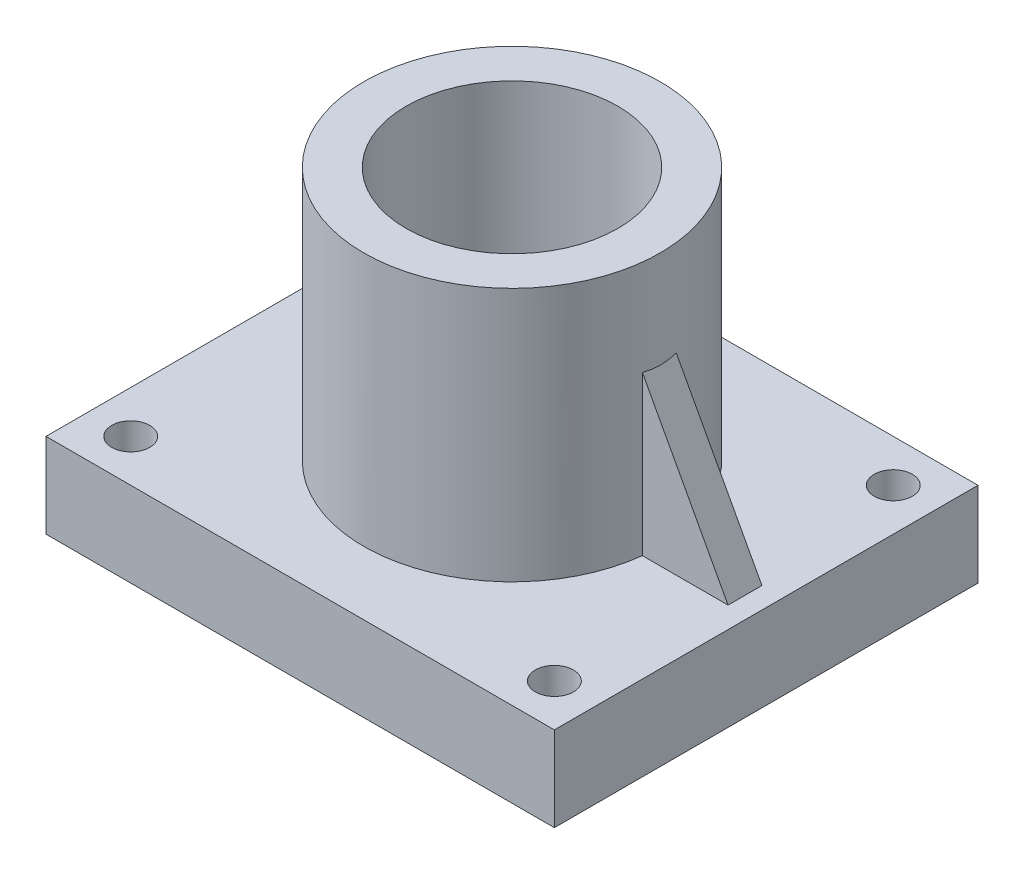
ISO-10303-21;
HEADER;
FILE_DESCRIPTION(('STEP AP214'),'2;1');
FILE_NAME('part.step','',(''),(''),'','','');
FILE_SCHEMA(('AUTOMOTIVE_DESIGN { 1 0 10303 214 1 1 1 1 }'));
ENDSEC;
DATA;
#1=APPLICATION_CONTEXT('core data for automotive mechanical design processes');
#2=APPLICATION_PROTOCOL_DEFINITION('international standard','automotive_design',2000,#1);
#3=PRODUCT_CONTEXT('',#1,'mechanical');
#4=PRODUCT('Part','Part','',(#3));
#5=PRODUCT_RELATED_PRODUCT_CATEGORY('part','',(#4));
#6=PRODUCT_DEFINITION_FORMATION('','',#4);
#7=PRODUCT_DEFINITION_CONTEXT('part definition',#1,'design');
#8=PRODUCT_DEFINITION('design','',#6,#7);
#9=PRODUCT_DEFINITION_SHAPE('','',#8);
#10=(LENGTH_UNIT() NAMED_UNIT(*) SI_UNIT(.MILLI.,.METRE.));
#11=(NAMED_UNIT(*) PLANE_ANGLE_UNIT() SI_UNIT($,.RADIAN.));
#12=(NAMED_UNIT(*) SI_UNIT($,.STERADIAN.) SOLID_ANGLE_UNIT());
#13=UNCERTAINTY_MEASURE_WITH_UNIT(LENGTH_MEASURE(1.E-05),#10,'distance_accuracy_value','');
#14=(GEOMETRIC_REPRESENTATION_CONTEXT(3) GLOBAL_UNCERTAINTY_ASSIGNED_CONTEXT((#13)) GLOBAL_UNIT_ASSIGNED_CONTEXT((#10,
#11,#12)) REPRESENTATION_CONTEXT('',''));
#15=CARTESIAN_POINT('',(0.,0.,0.));
#16=DIRECTION('',(0.,0.,1.));
#17=DIRECTION('',(1.,0.,0.));
#18=AXIS2_PLACEMENT_3D('',#15,#16,#17);
#19=CARTESIAN_POINT('',(0.,20.,0.));
#20=DIRECTION('',(0.,-1.,0.));
#21=DIRECTION('',(0.,0.,-1.));
#22=AXIS2_PLACEMENT_3D('',#19,#20,#21);
#23=PLANE('',#22);
#24=CARTESIAN_POINT('',(-50.,20.,40.));
#25=DIRECTION('',(0.,-1.,0.));
#26=DIRECTION('',(0.,0.,-1.));
#27=AXIS2_PLACEMENT_3D('',#24,#25,#26);
#28=CIRCLE('',#27,4.5);
#29=CARTESIAN_POINT('',(-50.,20.,35.5));
#30=VERTEX_POINT('',#29);
#31=EDGE_CURVE('E335',#30,#30,#28,.F.);
#32=ORIENTED_EDGE('',*,*,#31,.F.);
#33=EDGE_LOOP('',(#32));
#34=FACE_BOUND('',#33,.T.);
#35=CARTESIAN_POINT('',(50.,20.,40.));
#36=DIRECTION('',(0.,-1.,0.));
#37=DIRECTION('',(0.,0.,-1.));
#38=AXIS2_PLACEMENT_3D('',#35,#36,#37);
#39=CIRCLE('',#38,4.5);
#40=CARTESIAN_POINT('',(50.,20.,35.5));
#41=VERTEX_POINT('',#40);
#42=EDGE_CURVE('E338',#41,#41,#39,.F.);
#43=ORIENTED_EDGE('',*,*,#42,.F.);
#44=EDGE_LOOP('',(#43));
#45=FACE_BOUND('',#44,.T.);
#46=CARTESIAN_POINT('',(-50.,20.,-40.));
#47=DIRECTION('',(0.,-1.,0.));
#48=DIRECTION('',(0.,0.,-1.));
#49=AXIS2_PLACEMENT_3D('',#46,#47,#48);
#50=CIRCLE('',#49,4.5);
#51=CARTESIAN_POINT('',(-50.,20.,-44.5));
#52=VERTEX_POINT('',#51);
#53=EDGE_CURVE('E344',#52,#52,#50,.F.);
#54=ORIENTED_EDGE('',*,*,#53,.F.);
#55=EDGE_LOOP('',(#54));
#56=FACE_BOUND('',#55,.T.);
#57=CARTESIAN_POINT('',(50.,20.,-40.));
#58=DIRECTION('',(0.,-1.,0.));
#59=DIRECTION('',(0.,0.,-1.));
#60=AXIS2_PLACEMENT_3D('',#57,#58,#59);
#61=CIRCLE('',#60,4.5);
#62=CARTESIAN_POINT('',(50.,20.,-44.5));
#63=VERTEX_POINT('',#62);
#64=EDGE_CURVE('E133',#63,#63,#61,.F.);
#65=ORIENTED_EDGE('',*,*,#64,.F.);
#66=EDGE_LOOP('',(#65));
#67=FACE_BOUND('',#66,.T.);
#68=DIRECTION('',(0.,0.,-1.));
#69=VECTOR('',#68,1.);
#70=CARTESIAN_POINT('',(60.,20.,50.));
#71=LINE('',#70,#69);
#72=CARTESIAN_POINT('',(60.,20.,50.));
#73=VERTEX_POINT('',#72);
#74=CARTESIAN_POINT('',(60.,20.,-50.));
#75=VERTEX_POINT('',#74);
#76=EDGE_CURVE('E144',#73,#75,#71,.T.);
#77=ORIENTED_EDGE('',*,*,#76,.T.);
#78=DIRECTION('',(-1.,0.,0.));
#79=VECTOR('',#78,1.);
#80=CARTESIAN_POINT('',(-60.,20.,-50.));
#81=LINE('',#80,#79);
#82=CARTESIAN_POINT('',(-60.,20.,-50.));
#83=VERTEX_POINT('',#82);
#84=EDGE_CURVE('E94',#75,#83,#81,.T.);
#85=ORIENTED_EDGE('',*,*,#84,.T.);
#86=DIRECTION('',(0.,0.,1.));
#87=VECTOR('',#86,1.);
#88=CARTESIAN_POINT('',(-60.,20.,50.));
#89=LINE('',#88,#87);
#90=CARTESIAN_POINT('',(-60.,20.,50.));
#91=VERTEX_POINT('',#90);
#92=EDGE_CURVE('E146',#83,#91,#89,.T.);
#93=ORIENTED_EDGE('',*,*,#92,.T.);
#94=DIRECTION('',(1.,0.,0.));
#95=VECTOR('',#94,1.);
#96=CARTESIAN_POINT('',(-60.,20.,50.));
#97=LINE('',#96,#95);
#98=EDGE_CURVE('E64',#91,#73,#97,.T.);
#99=ORIENTED_EDGE('',*,*,#98,.T.);
#100=EDGE_LOOP('',(#77,#85,#93,#99));
#101=FACE_BOUND('',#100,.T.);
#102=DIRECTION('',(1.,0.,0.));
#103=VECTOR('',#102,1.);
#104=CARTESIAN_POINT('',(28.,20.,4.));
#105=LINE('',#104,#103);
#106=CARTESIAN_POINT('',(34.7706773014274,20.,4.));
#107=VERTEX_POINT('',#106);
#108=CARTESIAN_POINT('',(55.,20.,4.));
#109=VERTEX_POINT('',#108);
#110=EDGE_CURVE('E126',#107,#109,#105,.T.);
#111=ORIENTED_EDGE('',*,*,#110,.F.);
#112=CARTESIAN_POINT('',(0.,20.,0.));
#113=DIRECTION('',(0.,1.,0.));
#114=DIRECTION('',(0.,0.,1.));
#115=AXIS2_PLACEMENT_3D('',#112,#113,#114);
#116=CIRCLE('',#115,35.);
#117=CARTESIAN_POINT('',(34.7706773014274,20.,-4.));
#118=VERTEX_POINT('',#117);
#119=EDGE_CURVE('E127',#118,#107,#116,.T.);
#120=ORIENTED_EDGE('',*,*,#119,.F.);
#121=DIRECTION('',(1.,0.,0.));
#122=VECTOR('',#121,1.);
#123=CARTESIAN_POINT('',(28.,20.,-4.));
#124=LINE('',#123,#122);
#125=CARTESIAN_POINT('',(55.,20.,-4.));
#126=VERTEX_POINT('',#125);
#127=EDGE_CURVE('E121',#118,#126,#124,.T.);
#128=ORIENTED_EDGE('',*,*,#127,.T.);
#129=DIRECTION('',(0.,0.,1.));
#130=VECTOR('',#129,1.);
#131=CARTESIAN_POINT('',(55.,20.,-4.));
#132=LINE('',#131,#130);
#133=EDGE_CURVE('E108',#126,#109,#132,.T.);
#134=ORIENTED_EDGE('',*,*,#133,.T.);
#135=EDGE_LOOP('',(#111,#120,#128,#134));
#136=FACE_BOUND('',#135,.T.);
#137=ADVANCED_FACE('F41',(#34,#45,#56,#67,#101,#136),#23,.F.);
#138=CARTESIAN_POINT('',(0.,80.,0.));
#139=DIRECTION('',(0.,-1.,0.));
#140=DIRECTION('',(0.,0.,-1.));
#141=AXIS2_PLACEMENT_3D('',#138,#139,#140);
#142=CYLINDRICAL_SURFACE('',#141,35.);
#143=CARTESIAN_POINT('',(0.,80.,0.));
#144=DIRECTION('',(0.,1.,0.));
#145=DIRECTION('',(0.,0.,1.));
#146=AXIS2_PLACEMENT_3D('',#143,#144,#145);
#147=CIRCLE('',#146,35.);
#148=CARTESIAN_POINT('',(0.,80.,35.));
#149=VERTEX_POINT('',#148);
#150=EDGE_CURVE('E137',#149,#149,#147,.T.);
#151=ORIENTED_EDGE('',*,*,#150,.F.);
#152=EDGE_LOOP('',(#151));
#153=FACE_BOUND('',#152,.T.);
#154=DIRECTION('',(0.,-1.,0.));
#155=VECTOR('',#154,1.);
#156=CARTESIAN_POINT('',(34.7706773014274,80.,-4.));
#157=LINE('',#156,#155);
#158=CARTESIAN_POINT('',(34.7706773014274,57.4617087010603,-4.));
#159=VERTEX_POINT('',#158);
#160=EDGE_CURVE('E11',#118,#159,#157,.F.);
#161=ORIENTED_EDGE('',*,*,#160,.F.);
#162=ORIENTED_EDGE('',*,*,#119,.T.);
#163=DIRECTION('',(0.,-1.,0.));
#164=VECTOR('',#163,1.);
#165=CARTESIAN_POINT('',(34.7706773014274,80.,4.));
#166=LINE('',#165,#164);
#167=CARTESIAN_POINT('',(34.7706773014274,57.4617087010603,4.));
#168=VERTEX_POINT('',#167);
#169=EDGE_CURVE('E141',#107,#168,#166,.F.);
#170=ORIENTED_EDGE('',*,*,#169,.T.);
#171=CARTESIAN_POINT('',(0.,121.851851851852,0.));
#172=DIRECTION('',(0.879905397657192,0.475148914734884,0.));
#173=DIRECTION('',(0.475148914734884,-0.879905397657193,0.));
#174=AXIS2_PLACEMENT_3D('',#171,#172,#173);
#175=ELLIPSE('',#174,73.6611174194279,35.);
#176=EDGE_CURVE('E47',#168,#159,#175,.T.);
#177=ORIENTED_EDGE('',*,*,#176,.T.);
#178=EDGE_LOOP('',(#161,#162,#170,#177));
#179=FACE_BOUND('',#178,.T.);
#180=ADVANCED_FACE('F168',(#153,#179),#142,.T.);
#181=CARTESIAN_POINT('',(60.,20.,50.));
#182=DIRECTION('',(-1.,0.,0.));
#183=DIRECTION('',(0.,0.,1.));
#184=AXIS2_PLACEMENT_3D('',#181,#182,#183);
#185=PLANE('',#184);
#186=DIRECTION('',(0.,0.,-1.));
#187=VECTOR('',#186,1.);
#188=CARTESIAN_POINT('',(60.,0.,50.));
#189=LINE('',#188,#187);
#190=CARTESIAN_POINT('',(60.,0.,50.));
#191=VERTEX_POINT('',#190);
#192=CARTESIAN_POINT('',(60.,0.,-50.));
#193=VERTEX_POINT('',#192);
#194=EDGE_CURVE('E143',#191,#193,#189,.T.);
#195=ORIENTED_EDGE('',*,*,#194,.T.);
#196=DIRECTION('',(0.,-1.,0.));
#197=VECTOR('',#196,1.);
#198=CARTESIAN_POINT('',(60.,20.,-50.));
#199=LINE('',#198,#197);
#200=EDGE_CURVE('E145',#75,#193,#199,.T.);
#201=ORIENTED_EDGE('',*,*,#200,.F.);
#202=ORIENTED_EDGE('',*,*,#76,.F.);
#203=DIRECTION('',(0.,-1.,0.));
#204=VECTOR('',#203,1.);
#205=CARTESIAN_POINT('',(60.,20.,50.));
#206=LINE('',#205,#204);
#207=EDGE_CURVE('E151',#73,#191,#206,.T.);
#208=ORIENTED_EDGE('',*,*,#207,.T.);
#209=EDGE_LOOP('',(#195,#201,#202,#208));
#210=FACE_BOUND('',#209,.T.);
#211=ADVANCED_FACE('F43',(#210),#185,.F.);
#212=CARTESIAN_POINT('',(-60.,20.,-50.));
#213=DIRECTION('',(0.,0.,1.));
#214=DIRECTION('',(1.,0.,0.));
#215=AXIS2_PLACEMENT_3D('',#212,#213,#214);
#216=PLANE('',#215);
#217=DIRECTION('',(-1.,0.,0.));
#218=VECTOR('',#217,1.);
#219=CARTESIAN_POINT('',(-60.,0.,-50.));
#220=LINE('',#219,#218);
#221=CARTESIAN_POINT('',(-60.,0.,-50.));
#222=VERTEX_POINT('',#221);
#223=EDGE_CURVE('E152',#193,#222,#220,.T.);
#224=ORIENTED_EDGE('',*,*,#223,.T.);
#225=DIRECTION('',(0.,-1.,0.));
#226=VECTOR('',#225,1.);
#227=CARTESIAN_POINT('',(-60.,20.,-50.));
#228=LINE('',#227,#226);
#229=EDGE_CURVE('E165',#83,#222,#228,.T.);
#230=ORIENTED_EDGE('',*,*,#229,.F.);
#231=ORIENTED_EDGE('',*,*,#84,.F.);
#232=ORIENTED_EDGE('',*,*,#200,.T.);
#233=EDGE_LOOP('',(#224,#230,#231,#232));
#234=FACE_BOUND('',#233,.T.);
#235=ADVANCED_FACE('F202',(#234),#216,.F.);
#236=CARTESIAN_POINT('',(-60.,20.,50.));
#237=DIRECTION('',(1.,0.,0.));
#238=DIRECTION('',(0.,0.,-1.));
#239=AXIS2_PLACEMENT_3D('',#236,#237,#238);
#240=PLANE('',#239);
#241=DIRECTION('',(0.,0.,1.));
#242=VECTOR('',#241,1.);
#243=CARTESIAN_POINT('',(-60.,0.,50.));
#244=LINE('',#243,#242);
#245=CARTESIAN_POINT('',(-60.,0.,50.));
#246=VERTEX_POINT('',#245);
#247=EDGE_CURVE('E156',#222,#246,#244,.T.);
#248=ORIENTED_EDGE('',*,*,#247,.T.);
#249=DIRECTION('',(0.,-1.,0.));
#250=VECTOR('',#249,1.);
#251=CARTESIAN_POINT('',(-60.,20.,50.));
#252=LINE('',#251,#250);
#253=EDGE_CURVE('E159',#91,#246,#252,.T.);
#254=ORIENTED_EDGE('',*,*,#253,.F.);
#255=ORIENTED_EDGE('',*,*,#92,.F.);
#256=ORIENTED_EDGE('',*,*,#229,.T.);
#257=EDGE_LOOP('',(#248,#254,#255,#256));
#258=FACE_BOUND('',#257,.T.);
#259=ADVANCED_FACE('F201',(#258),#240,.F.);
#260=CARTESIAN_POINT('',(-60.,20.,50.));
#261=DIRECTION('',(0.,0.,-1.));
#262=DIRECTION('',(-1.,0.,0.));
#263=AXIS2_PLACEMENT_3D('',#260,#261,#262);
#264=PLANE('',#263);
#265=DIRECTION('',(1.,0.,0.));
#266=VECTOR('',#265,1.);
#267=CARTESIAN_POINT('',(-60.,0.,50.));
#268=LINE('',#267,#266);
#269=EDGE_CURVE('E88',#246,#191,#268,.T.);
#270=ORIENTED_EDGE('',*,*,#269,.T.);
#271=ORIENTED_EDGE('',*,*,#207,.F.);
#272=ORIENTED_EDGE('',*,*,#98,.F.);
#273=ORIENTED_EDGE('',*,*,#253,.T.);
#274=EDGE_LOOP('',(#270,#271,#272,#273));
#275=FACE_BOUND('',#274,.T.);
#276=ADVANCED_FACE('F200',(#275),#264,.F.);
#277=CARTESIAN_POINT('',(0.,0.,0.));
#278=DIRECTION('',(0.,-1.,0.));
#279=DIRECTION('',(0.,0.,-1.));
#280=AXIS2_PLACEMENT_3D('',#277,#278,#279);
#281=PLANE('',#280);
#282=CARTESIAN_POINT('',(-50.,0.,40.));
#283=DIRECTION('',(0.,1.,0.));
#284=DIRECTION('',(0.,0.,1.));
#285=AXIS2_PLACEMENT_3D('',#282,#283,#284);
#286=CIRCLE('',#285,4.5);
#287=CARTESIAN_POINT('',(-50.,0.,44.5));
#288=VERTEX_POINT('',#287);
#289=EDGE_CURVE('E329',#288,#288,#286,.T.);
#290=ORIENTED_EDGE('',*,*,#289,.T.);
#291=EDGE_LOOP('',(#290));
#292=FACE_BOUND('',#291,.T.);
#293=CARTESIAN_POINT('',(50.,0.,40.));
#294=DIRECTION('',(0.,1.,0.));
#295=DIRECTION('',(0.,0.,1.));
#296=AXIS2_PLACEMENT_3D('',#293,#294,#295);
#297=CIRCLE('',#296,4.5);
#298=CARTESIAN_POINT('',(50.,0.,44.5));
#299=VERTEX_POINT('',#298);
#300=EDGE_CURVE('E334',#299,#299,#297,.T.);
#301=ORIENTED_EDGE('',*,*,#300,.T.);
#302=EDGE_LOOP('',(#301));
#303=FACE_BOUND('',#302,.T.);
#304=CARTESIAN_POINT('',(-50.,0.,-40.));
#305=DIRECTION('',(0.,1.,0.));
#306=DIRECTION('',(0.,0.,1.));
#307=AXIS2_PLACEMENT_3D('',#304,#305,#306);
#308=CIRCLE('',#307,4.5);
#309=CARTESIAN_POINT('',(-50.,0.,-35.5));
#310=VERTEX_POINT('',#309);
#311=EDGE_CURVE('E345',#310,#310,#308,.T.);
#312=ORIENTED_EDGE('',*,*,#311,.T.);
#313=EDGE_LOOP('',(#312));
#314=FACE_BOUND('',#313,.T.);
#315=CARTESIAN_POINT('',(50.,0.,-40.));
#316=DIRECTION('',(0.,1.,0.));
#317=DIRECTION('',(0.,0.,1.));
#318=AXIS2_PLACEMENT_3D('',#315,#316,#317);
#319=CIRCLE('',#318,4.5);
#320=CARTESIAN_POINT('',(50.,0.,-35.5));
#321=VERTEX_POINT('',#320);
#322=EDGE_CURVE('E350',#321,#321,#319,.T.);
#323=ORIENTED_EDGE('',*,*,#322,.T.);
#324=EDGE_LOOP('',(#323));
#325=FACE_BOUND('',#324,.T.);
#326=CARTESIAN_POINT('',(0.,0.,0.));
#327=DIRECTION('',(0.,1.,0.));
#328=DIRECTION('',(0.,0.,1.));
#329=AXIS2_PLACEMENT_3D('',#326,#327,#328);
#330=CIRCLE('',#329,25.);
#331=CARTESIAN_POINT('',(0.,0.,25.));
#332=VERTEX_POINT('',#331);
#333=EDGE_CURVE('E120',#332,#332,#330,.T.);
#334=ORIENTED_EDGE('',*,*,#333,.T.);
#335=EDGE_LOOP('',(#334));
#336=FACE_BOUND('',#335,.T.);
#337=ORIENTED_EDGE('',*,*,#194,.F.);
#338=ORIENTED_EDGE('',*,*,#269,.F.);
#339=ORIENTED_EDGE('',*,*,#247,.F.);
#340=ORIENTED_EDGE('',*,*,#223,.F.);
#341=EDGE_LOOP('',(#337,#338,#339,#340));
#342=FACE_BOUND('',#341,.T.);
#343=ADVANCED_FACE('F198',(#292,#303,#314,#325,#336,#342),#281,.T.);
#344=CARTESIAN_POINT('',(0.,80.,0.));
#345=DIRECTION('',(0.,1.,0.));
#346=DIRECTION('',(0.,0.,1.));
#347=AXIS2_PLACEMENT_3D('',#344,#345,#346);
#348=PLANE('',#347);
#349=CARTESIAN_POINT('',(0.,80.,0.));
#350=DIRECTION('',(0.,1.,0.));
#351=DIRECTION('',(0.,0.,1.));
#352=AXIS2_PLACEMENT_3D('',#349,#350,#351);
#353=CIRCLE('',#352,25.);
#354=CARTESIAN_POINT('',(0.,80.,25.));
#355=VERTEX_POINT('',#354);
#356=EDGE_CURVE('E140',#355,#355,#353,.F.);
#357=ORIENTED_EDGE('',*,*,#356,.T.);
#358=EDGE_LOOP('',(#357));
#359=FACE_BOUND('',#358,.T.);
#360=ORIENTED_EDGE('',*,*,#150,.T.);
#361=EDGE_LOOP('',(#360));
#362=FACE_BOUND('',#361,.T.);
#363=ADVANCED_FACE('F196',(#359,#362),#348,.T.);
#364=CARTESIAN_POINT('',(0.,85.,0.));
#365=DIRECTION('',(0.,-1.,0.));
#366=DIRECTION('',(0.,0.,-1.));
#367=AXIS2_PLACEMENT_3D('',#364,#365,#366);
#368=CYLINDRICAL_SURFACE('',#367,25.);
#369=ORIENTED_EDGE('',*,*,#356,.F.);
#370=EDGE_LOOP('',(#369));
#371=FACE_BOUND('',#370,.T.);
#372=ORIENTED_EDGE('',*,*,#333,.F.);
#373=EDGE_LOOP('',(#372));
#374=FACE_BOUND('',#373,.T.);
#375=ADVANCED_FACE('F179',(#371,#374),#368,.F.);
#376=CARTESIAN_POINT('',(0.,0.,-4.));
#377=DIRECTION('',(0.,0.,1.));
#378=DIRECTION('',(1.,0.,0.));
#379=AXIS2_PLACEMENT_3D('',#376,#377,#378);
#380=PLANE('',#379);
#381=ORIENTED_EDGE('',*,*,#127,.F.);
#382=ORIENTED_EDGE('',*,*,#160,.T.);
#383=DIRECTION('',(-0.475148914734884,0.879905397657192,0.));
#384=VECTOR('',#383,1.);
#385=CARTESIAN_POINT('',(55.,20.,-4.));
#386=LINE('',#385,#384);
#387=EDGE_CURVE('E115',#126,#159,#386,.T.);
#388=ORIENTED_EDGE('',*,*,#387,.F.);
#389=EDGE_LOOP('',(#381,#382,#388));
#390=FACE_BOUND('',#389,.T.);
#391=ADVANCED_FACE('F119',(#390),#380,.F.);
#392=CARTESIAN_POINT('',(0.,0.,4.));
#393=DIRECTION('',(0.,0.,1.));
#394=DIRECTION('',(1.,0.,0.));
#395=AXIS2_PLACEMENT_3D('',#392,#393,#394);
#396=PLANE('',#395);
#397=ORIENTED_EDGE('',*,*,#169,.F.);
#398=ORIENTED_EDGE('',*,*,#110,.T.);
#399=DIRECTION('',(-0.475148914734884,0.879905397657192,0.));
#400=VECTOR('',#399,1.);
#401=CARTESIAN_POINT('',(55.,20.,4.));
#402=LINE('',#401,#400);
#403=EDGE_CURVE('E57',#109,#168,#402,.T.);
#404=ORIENTED_EDGE('',*,*,#403,.T.);
#405=EDGE_LOOP('',(#397,#398,#404));
#406=FACE_BOUND('',#405,.T.);
#407=ADVANCED_FACE('F173',(#406),#396,.T.);
#408=CARTESIAN_POINT('',(55.,20.,-4.));
#409=DIRECTION('',(0.879905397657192,0.475148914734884,0.));
#410=DIRECTION('',(-0.475148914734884,0.879905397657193,0.));
#411=AXIS2_PLACEMENT_3D('',#408,#409,#410);
#412=PLANE('',#411);
#413=ORIENTED_EDGE('',*,*,#176,.F.);
#414=ORIENTED_EDGE('',*,*,#403,.F.);
#415=ORIENTED_EDGE('',*,*,#133,.F.);
#416=ORIENTED_EDGE('',*,*,#387,.T.);
#417=EDGE_LOOP('',(#413,#414,#415,#416));
#418=FACE_BOUND('',#417,.T.);
#419=ADVANCED_FACE('F112',(#418),#412,.T.);
#420=CARTESIAN_POINT('',(50.,25.,-40.));
#421=DIRECTION('',(0.,-1.,0.));
#422=DIRECTION('',(0.,0.,-1.));
#423=AXIS2_PLACEMENT_3D('',#420,#421,#422);
#424=CYLINDRICAL_SURFACE('',#423,4.5);
#425=ORIENTED_EDGE('',*,*,#322,.F.);
#426=EDGE_LOOP('',(#425));
#427=FACE_BOUND('',#426,.T.);
#428=ORIENTED_EDGE('',*,*,#64,.T.);
#429=EDGE_LOOP('',(#428));
#430=FACE_BOUND('',#429,.T.);
#431=ADVANCED_FACE('F177',(#427,#430),#424,.F.);
#432=CARTESIAN_POINT('',(-50.,25.,-40.));
#433=DIRECTION('',(0.,-1.,0.));
#434=DIRECTION('',(0.,0.,-1.));
#435=AXIS2_PLACEMENT_3D('',#432,#433,#434);
#436=CYLINDRICAL_SURFACE('',#435,4.5);
#437=ORIENTED_EDGE('',*,*,#311,.F.);
#438=EDGE_LOOP('',(#437));
#439=FACE_BOUND('',#438,.T.);
#440=ORIENTED_EDGE('',*,*,#53,.T.);
#441=EDGE_LOOP('',(#440));
#442=FACE_BOUND('',#441,.T.);
#443=ADVANCED_FACE('F298',(#439,#442),#436,.F.);
#444=CARTESIAN_POINT('',(50.,25.,40.));
#445=DIRECTION('',(0.,-1.,0.));
#446=DIRECTION('',(0.,0.,-1.));
#447=AXIS2_PLACEMENT_3D('',#444,#445,#446);
#448=CYLINDRICAL_SURFACE('',#447,4.5);
#449=ORIENTED_EDGE('',*,*,#300,.F.);
#450=EDGE_LOOP('',(#449));
#451=FACE_BOUND('',#450,.T.);
#452=ORIENTED_EDGE('',*,*,#42,.T.);
#453=EDGE_LOOP('',(#452));
#454=FACE_BOUND('',#453,.T.);
#455=ADVANCED_FACE('F308',(#451,#454),#448,.F.);
#456=CARTESIAN_POINT('',(-50.,25.,40.));
#457=DIRECTION('',(0.,-1.,0.));
#458=DIRECTION('',(0.,0.,-1.));
#459=AXIS2_PLACEMENT_3D('',#456,#457,#458);
#460=CYLINDRICAL_SURFACE('',#459,4.5);
#461=ORIENTED_EDGE('',*,*,#289,.F.);
#462=EDGE_LOOP('',(#461));
#463=FACE_BOUND('',#462,.T.);
#464=ORIENTED_EDGE('',*,*,#31,.T.);
#465=EDGE_LOOP('',(#464));
#466=FACE_BOUND('',#465,.T.);
#467=ADVANCED_FACE('F312',(#463,#466),#460,.F.);
#468=CLOSED_SHELL('',(#137,#180,#211,#235,#259,#276,#343,#363,#375,#391,#407,#419,#431,#443,
#455,#467));
#469=MANIFOLD_SOLID_BREP('B2',#468);
#470=ADVANCED_BREP_SHAPE_REPRESENTATION('',(#18,#469),#14);
#471=SHAPE_DEFINITION_REPRESENTATION(#9,#470);
ENDSEC;
END-ISO-10303-21;
